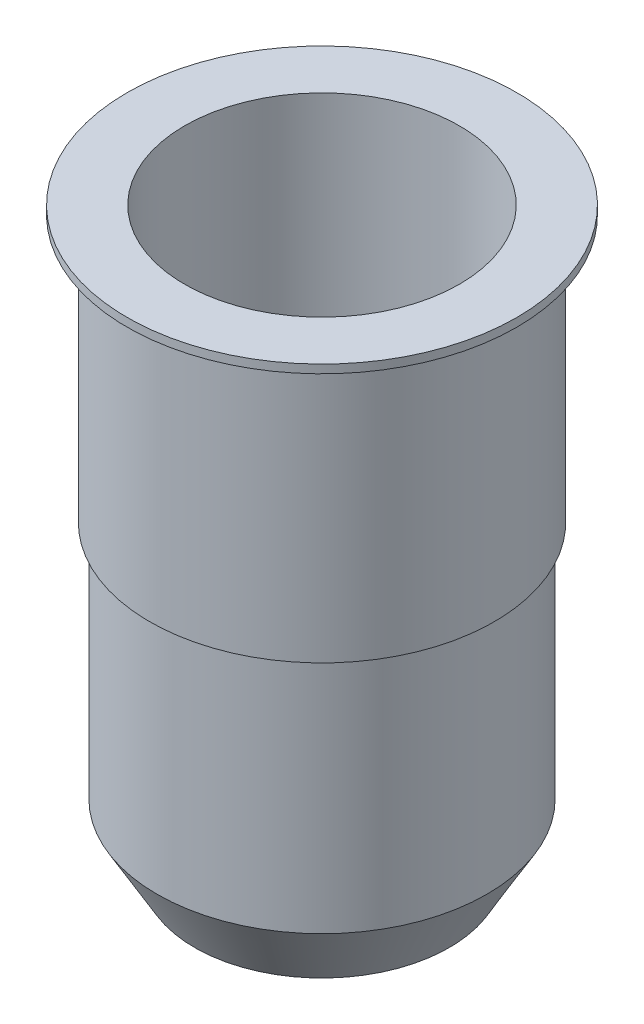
ISO-10303-21;
HEADER;
FILE_DESCRIPTION(('STEP AP214'),'2;1');
FILE_NAME('part.step','',(''),(''),'','','');
FILE_SCHEMA(('AUTOMOTIVE_DESIGN { 1 0 10303 214 1 1 1 1 }'));
ENDSEC;
DATA;
#1=APPLICATION_CONTEXT('core data for automotive mechanical design processes');
#2=APPLICATION_PROTOCOL_DEFINITION('international standard','automotive_design',2000,#1);
#3=PRODUCT_CONTEXT('',#1,'mechanical');
#4=PRODUCT('Part','Part','',(#3));
#5=PRODUCT_RELATED_PRODUCT_CATEGORY('part','',(#4));
#6=PRODUCT_DEFINITION_FORMATION('','',#4);
#7=PRODUCT_DEFINITION_CONTEXT('part definition',#1,'design');
#8=PRODUCT_DEFINITION('design','',#6,#7);
#9=PRODUCT_DEFINITION_SHAPE('','',#8);
#10=(LENGTH_UNIT() NAMED_UNIT(*) SI_UNIT(.MILLI.,.METRE.));
#11=(NAMED_UNIT(*) PLANE_ANGLE_UNIT() SI_UNIT($,.RADIAN.));
#12=(NAMED_UNIT(*) SI_UNIT($,.STERADIAN.) SOLID_ANGLE_UNIT());
#13=UNCERTAINTY_MEASURE_WITH_UNIT(LENGTH_MEASURE(1.E-05),#10,'distance_accuracy_value','');
#14=(GEOMETRIC_REPRESENTATION_CONTEXT(3) GLOBAL_UNCERTAINTY_ASSIGNED_CONTEXT((#13)) GLOBAL_UNIT_ASSIGNED_CONTEXT((#10,
#11,#12)) REPRESENTATION_CONTEXT('',''));
#15=CARTESIAN_POINT('',(0.,0.,0.));
#16=DIRECTION('',(0.,0.,1.));
#17=DIRECTION('',(1.,0.,0.));
#18=AXIS2_PLACEMENT_3D('',#15,#16,#17);
#19=CARTESIAN_POINT('',(3.3,-11.6,0.));
#20=DIRECTION('',(0.,1.,0.));
#21=DIRECTION('',(-1.,0.,0.));
#22=AXIS2_PLACEMENT_3D('',#19,#20,#21);
#23=PLANE('',#22);
#24=CARTESIAN_POINT('',(0.,-11.6,0.));
#25=DIRECTION('',(0.,1.,0.));
#26=DIRECTION('',(-1.,0.,0.));
#27=AXIS2_PLACEMENT_3D('',#24,#25,#26);
#28=CIRCLE('',#27,2.55);
#29=CARTESIAN_POINT('',(-2.54999999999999,-11.6,0.));
#30=VERTEX_POINT('',#29);
#31=EDGE_CURVE('E36',#30,#30,#28,.F.);
#32=ORIENTED_EDGE('',*,*,#31,.T.);
#33=EDGE_LOOP('',(#32));
#34=FACE_BOUND('',#33,.T.);
#35=CARTESIAN_POINT('',(0.,-11.6,0.));
#36=DIRECTION('',(0.,1.,0.));
#37=DIRECTION('',(-1.,0.,0.));
#38=AXIS2_PLACEMENT_3D('',#35,#36,#37);
#39=CIRCLE('',#38,2.1);
#40=CARTESIAN_POINT('',(-2.1,-11.6,0.));
#41=VERTEX_POINT('',#40);
#42=EDGE_CURVE('E45',#41,#41,#39,.T.);
#43=ORIENTED_EDGE('',*,*,#42,.T.);
#44=EDGE_LOOP('',(#43));
#45=FACE_BOUND('',#44,.T.);
#46=ADVANCED_FACE('F26',(#34,#45),#23,.F.);
#47=CARTESIAN_POINT('',(0.,6.30148961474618,0.));
#48=DIRECTION('',(0.,1.,0.));
#49=DIRECTION('',(-1.,0.,0.));
#50=AXIS2_PLACEMENT_3D('',#47,#48,#49);
#51=CYLINDRICAL_SURFACE('',#50,2.1);
#52=ORIENTED_EDGE('',*,*,#42,.F.);
#53=EDGE_LOOP('',(#52));
#54=FACE_BOUND('',#53,.T.);
#55=CARTESIAN_POINT('',(0.,-6.,0.));
#56=DIRECTION('',(0.,1.,0.));
#57=DIRECTION('',(-1.,0.,0.));
#58=AXIS2_PLACEMENT_3D('',#55,#56,#57);
#59=CIRCLE('',#58,2.1);
#60=CARTESIAN_POINT('',(-2.1,-6.,0.));
#61=VERTEX_POINT('',#60);
#62=EDGE_CURVE('E48',#61,#61,#59,.T.);
#63=ORIENTED_EDGE('',*,*,#62,.T.);
#64=EDGE_LOOP('',(#63));
#65=FACE_BOUND('',#64,.T.);
#66=ADVANCED_FACE('F88',(#54,#65),#51,.F.);
#67=CARTESIAN_POINT('',(2.1,-6.,0.));
#68=DIRECTION('',(0.,-1.,0.));
#69=DIRECTION('',(1.,0.,0.));
#70=AXIS2_PLACEMENT_3D('',#67,#68,#69);
#71=PLANE('',#70);
#72=ORIENTED_EDGE('',*,*,#62,.F.);
#73=EDGE_LOOP('',(#72));
#74=FACE_BOUND('',#73,.T.);
#75=CARTESIAN_POINT('',(0.,-6.,0.));
#76=DIRECTION('',(0.,1.,0.));
#77=DIRECTION('',(-1.,0.,0.));
#78=AXIS2_PLACEMENT_3D('',#75,#76,#77);
#79=CIRCLE('',#78,2.75);
#80=CARTESIAN_POINT('',(-2.75,-6.,0.));
#81=VERTEX_POINT('',#80);
#82=EDGE_CURVE('E51',#81,#81,#79,.T.);
#83=ORIENTED_EDGE('',*,*,#82,.T.);
#84=EDGE_LOOP('',(#83));
#85=FACE_BOUND('',#84,.T.);
#86=ADVANCED_FACE('F93',(#74,#85),#71,.F.);
#87=CARTESIAN_POINT('',(0.,6.30148961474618,0.));
#88=DIRECTION('',(0.,1.,0.));
#89=DIRECTION('',(-1.,0.,0.));
#90=AXIS2_PLACEMENT_3D('',#87,#88,#89);
#91=CYLINDRICAL_SURFACE('',#90,2.75);
#92=ORIENTED_EDGE('',*,*,#82,.F.);
#93=EDGE_LOOP('',(#92));
#94=FACE_BOUND('',#93,.T.);
#95=CARTESIAN_POINT('',(0.,0.,0.));
#96=DIRECTION('',(0.,1.,0.));
#97=DIRECTION('',(-1.,0.,0.));
#98=AXIS2_PLACEMENT_3D('',#95,#96,#97);
#99=CIRCLE('',#98,2.75);
#100=CARTESIAN_POINT('',(-2.75,0.,0.));
#101=VERTEX_POINT('',#100);
#102=EDGE_CURVE('E54',#101,#101,#99,.T.);
#103=ORIENTED_EDGE('',*,*,#102,.T.);
#104=EDGE_LOOP('',(#103));
#105=FACE_BOUND('',#104,.T.);
#106=ADVANCED_FACE('F103',(#94,#105),#91,.F.);
#107=CARTESIAN_POINT('',(2.75,0.,0.));
#108=DIRECTION('',(0.,-1.,0.));
#109=DIRECTION('',(1.,0.,0.));
#110=AXIS2_PLACEMENT_3D('',#107,#108,#109);
#111=PLANE('',#110);
#112=ORIENTED_EDGE('',*,*,#102,.F.);
#113=EDGE_LOOP('',(#112));
#114=FACE_BOUND('',#113,.T.);
#115=CARTESIAN_POINT('',(0.,0.,0.));
#116=DIRECTION('',(0.,1.,0.));
#117=DIRECTION('',(-1.,0.,0.));
#118=AXIS2_PLACEMENT_3D('',#115,#116,#117);
#119=CIRCLE('',#118,3.9);
#120=CARTESIAN_POINT('',(-3.9,0.,0.));
#121=VERTEX_POINT('',#120);
#122=EDGE_CURVE('E57',#121,#121,#119,.T.);
#123=ORIENTED_EDGE('',*,*,#122,.T.);
#124=EDGE_LOOP('',(#123));
#125=FACE_BOUND('',#124,.T.);
#126=ADVANCED_FACE('F109',(#114,#125),#111,.F.);
#127=CARTESIAN_POINT('',(0.,6.30148961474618,0.));
#128=DIRECTION('',(0.,1.,0.));
#129=DIRECTION('',(-1.,0.,0.));
#130=AXIS2_PLACEMENT_3D('',#127,#128,#129);
#131=CYLINDRICAL_SURFACE('',#130,3.9);
#132=CARTESIAN_POINT('',(0.,-0.16905989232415,0.));
#133=DIRECTION('',(0.,1.,0.));
#134=DIRECTION('',(-1.,0.,0.));
#135=AXIS2_PLACEMENT_3D('',#132,#133,#134);
#136=CIRCLE('',#135,3.9);
#137=CARTESIAN_POINT('',(-3.9,-0.169059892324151,0.));
#138=VERTEX_POINT('',#137);
#139=EDGE_CURVE('E32',#138,#138,#136,.T.);
#140=ORIENTED_EDGE('',*,*,#139,.T.);
#141=EDGE_LOOP('',(#140));
#142=FACE_BOUND('',#141,.T.);
#143=ORIENTED_EDGE('',*,*,#122,.F.);
#144=EDGE_LOOP('',(#143));
#145=FACE_BOUND('',#144,.T.);
#146=ADVANCED_FACE('F115',(#142,#145),#131,.T.);
#147=CARTESIAN_POINT('',(3.44999999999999,-0.4,0.));
#148=DIRECTION('',(0.,1.,0.));
#149=DIRECTION('',(-1.,0.,0.));
#150=AXIS2_PLACEMENT_3D('',#147,#148,#149);
#151=PLANE('',#150);
#152=CARTESIAN_POINT('',(0.,-0.400000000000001,0.));
#153=DIRECTION('',(0.,1.,0.));
#154=DIRECTION('',(-1.,0.,0.));
#155=AXIS2_PLACEMENT_3D('',#152,#153,#154);
#156=CIRCLE('',#155,3.5);
#157=CARTESIAN_POINT('',(-3.5,-0.400000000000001,0.));
#158=VERTEX_POINT('',#157);
#159=EDGE_CURVE('E10',#158,#158,#156,.F.);
#160=ORIENTED_EDGE('',*,*,#159,.T.);
#161=EDGE_LOOP('',(#160));
#162=FACE_BOUND('',#161,.T.);
#163=CARTESIAN_POINT('',(0.,-0.400000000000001,0.));
#164=DIRECTION('',(0.,1.,0.));
#165=DIRECTION('',(-1.,0.,0.));
#166=AXIS2_PLACEMENT_3D('',#163,#164,#165);
#167=CIRCLE('',#166,3.44999999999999);
#168=CARTESIAN_POINT('',(-3.44999999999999,-0.400000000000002,0.));
#169=VERTEX_POINT('',#168);
#170=EDGE_CURVE('E60',#169,#169,#167,.T.);
#171=ORIENTED_EDGE('',*,*,#170,.T.);
#172=EDGE_LOOP('',(#171));
#173=FACE_BOUND('',#172,.T.);
#174=ADVANCED_FACE('F120',(#162,#173),#151,.F.);
#175=CARTESIAN_POINT('',(0.,6.30148961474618,0.));
#176=DIRECTION('',(0.,1.,0.));
#177=DIRECTION('',(-1.,0.,0.));
#178=AXIS2_PLACEMENT_3D('',#175,#176,#177);
#179=CYLINDRICAL_SURFACE('',#178,3.44999999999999);
#180=ORIENTED_EDGE('',*,*,#170,.F.);
#181=EDGE_LOOP('',(#180));
#182=FACE_BOUND('',#181,.T.);
#183=CARTESIAN_POINT('',(0.,-5.5,0.));
#184=DIRECTION('',(0.,1.,0.));
#185=DIRECTION('',(-1.,0.,0.));
#186=AXIS2_PLACEMENT_3D('',#183,#184,#185);
#187=CIRCLE('',#186,3.44999999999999);
#188=CARTESIAN_POINT('',(-3.44999999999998,-5.5,0.));
#189=VERTEX_POINT('',#188);
#190=EDGE_CURVE('E63',#189,#189,#187,.T.);
#191=ORIENTED_EDGE('',*,*,#190,.T.);
#192=EDGE_LOOP('',(#191));
#193=FACE_BOUND('',#192,.T.);
#194=ADVANCED_FACE('F84',(#182,#193),#179,.T.);
#195=CARTESIAN_POINT('',(3.3,-5.5,0.));
#196=DIRECTION('',(0.,1.,0.));
#197=DIRECTION('',(-1.,0.,0.));
#198=AXIS2_PLACEMENT_3D('',#195,#196,#197);
#199=PLANE('',#198);
#200=ORIENTED_EDGE('',*,*,#190,.F.);
#201=EDGE_LOOP('',(#200));
#202=FACE_BOUND('',#201,.T.);
#203=CARTESIAN_POINT('',(0.,-5.5,0.));
#204=DIRECTION('',(0.,1.,0.));
#205=DIRECTION('',(-1.,0.,0.));
#206=AXIS2_PLACEMENT_3D('',#203,#204,#205);
#207=CIRCLE('',#206,3.3);
#208=CARTESIAN_POINT('',(-3.3,-5.5,0.));
#209=VERTEX_POINT('',#208);
#210=EDGE_CURVE('E66',#209,#209,#207,.T.);
#211=ORIENTED_EDGE('',*,*,#210,.T.);
#212=EDGE_LOOP('',(#211));
#213=FACE_BOUND('',#212,.T.);
#214=ADVANCED_FACE('F70',(#202,#213),#199,.F.);
#215=CARTESIAN_POINT('',(0.,6.30148961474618,0.));
#216=DIRECTION('',(0.,1.,0.));
#217=DIRECTION('',(-1.,0.,0.));
#218=AXIS2_PLACEMENT_3D('',#215,#216,#217);
#219=CYLINDRICAL_SURFACE('',#218,3.3);
#220=CARTESIAN_POINT('',(0.,-10.3009618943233,0.));
#221=DIRECTION('',(0.,1.,0.));
#222=DIRECTION('',(-1.,0.,0.));
#223=AXIS2_PLACEMENT_3D('',#220,#221,#222);
#224=CIRCLE('',#223,3.3);
#225=CARTESIAN_POINT('',(-3.3,-10.3009618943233,0.));
#226=VERTEX_POINT('',#225);
#227=EDGE_CURVE('E40',#226,#226,#224,.T.);
#228=ORIENTED_EDGE('',*,*,#227,.T.);
#229=EDGE_LOOP('',(#228));
#230=FACE_BOUND('',#229,.T.);
#231=ORIENTED_EDGE('',*,*,#210,.F.);
#232=EDGE_LOOP('',(#231));
#233=FACE_BOUND('',#232,.T.);
#234=ADVANCED_FACE('F72',(#230,#233),#219,.T.);
#235=CARTESIAN_POINT('',(0.,-10.3009618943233,0.));
#236=DIRECTION('',(0.,1.,0.));
#237=DIRECTION('',(-1.,0.,0.));
#238=AXIS2_PLACEMENT_3D('',#235,#236,#237);
#239=CONICAL_SURFACE('',#238,3.3,0.5235987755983);
#240=CARTESIAN_POINT('',(-2.54999999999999,-11.6,0.));
#241=CARTESIAN_POINT('',(-2.55781249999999,-11.5864683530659,0.));
#242=CARTESIAN_POINT('',(-2.56562499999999,-11.5729367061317,0.));
#243=CARTESIAN_POINT('',(-2.58124999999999,-11.5458734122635,0.));
#244=CARTESIAN_POINT('',(-2.58906249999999,-11.5323417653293,0.));
#245=CARTESIAN_POINT('',(-2.60468749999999,-11.5052784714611,0.));
#246=CARTESIAN_POINT('',(-2.61249999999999,-11.4917468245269,0.));
#247=CARTESIAN_POINT('',(-2.62812499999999,-11.4646835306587,0.));
#248=CARTESIAN_POINT('',(-2.63593749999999,-11.4511518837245,0.));
#249=CARTESIAN_POINT('',(-2.65156249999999,-11.4240885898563,0.));
#250=CARTESIAN_POINT('',(-2.65937499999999,-11.4105569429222,0.));
#251=CARTESIAN_POINT('',(-2.67499999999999,-11.3834936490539,0.));
#252=CARTESIAN_POINT('',(-2.68281249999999,-11.3699620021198,0.));
#253=CARTESIAN_POINT('',(-2.69843749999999,-11.3428987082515,0.));
#254=CARTESIAN_POINT('',(-2.70624999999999,-11.3293670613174,0.));
#255=CARTESIAN_POINT('',(-2.72187499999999,-11.3023037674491,0.));
#256=CARTESIAN_POINT('',(-2.72968749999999,-11.288772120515,0.));
#257=CARTESIAN_POINT('',(-2.74531249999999,-11.2617088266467,0.));
#258=CARTESIAN_POINT('',(-2.753125,-11.2481771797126,0.));
#259=CARTESIAN_POINT('',(-2.76875,-11.2211138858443,0.));
#260=CARTESIAN_POINT('',(-2.7765625,-11.2075822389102,0.));
#261=CARTESIAN_POINT('',(-2.7921875,-11.1805189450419,0.));
#262=CARTESIAN_POINT('',(-2.8,-11.1669872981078,0.));
#263=CARTESIAN_POINT('',(-2.815625,-11.1399240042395,0.));
#264=CARTESIAN_POINT('',(-2.8234375,-11.1263923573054,0.));
#265=CARTESIAN_POINT('',(-2.8390625,-11.0993290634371,0.));
#266=CARTESIAN_POINT('',(-2.846875,-11.085797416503,0.));
#267=CARTESIAN_POINT('',(-2.8625,-11.0587341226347,0.));
#268=CARTESIAN_POINT('',(-2.8703125,-11.0452024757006,0.));
#269=CARTESIAN_POINT('',(-2.8859375,-11.0181391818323,0.));
#270=CARTESIAN_POINT('',(-2.89375,-11.0046075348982,0.));
#271=CARTESIAN_POINT('',(-2.909375,-10.9775442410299,0.));
#272=CARTESIAN_POINT('',(-2.9171875,-10.9640125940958,0.));
#273=CARTESIAN_POINT('',(-2.9328125,-10.9369493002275,0.));
#274=CARTESIAN_POINT('',(-2.940625,-10.9234176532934,0.));
#275=CARTESIAN_POINT('',(-2.95625,-10.8963543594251,0.));
#276=CARTESIAN_POINT('',(-2.9640625,-10.882822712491,0.));
#277=CARTESIAN_POINT('',(-2.9796875,-10.8557594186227,0.));
#278=CARTESIAN_POINT('',(-2.9875,-10.8422277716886,0.));
#279=CARTESIAN_POINT('',(-3.003125,-10.8151644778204,0.));
#280=CARTESIAN_POINT('',(-3.0109375,-10.8016328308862,0.));
#281=CARTESIAN_POINT('',(-3.0265625,-10.774569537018,0.));
#282=CARTESIAN_POINT('',(-3.034375,-10.7610378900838,0.));
#283=CARTESIAN_POINT('',(-3.05,-10.7339745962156,0.));
#284=CARTESIAN_POINT('',(-3.0578125,-10.7204429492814,0.));
#285=CARTESIAN_POINT('',(-3.0734375,-10.6933796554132,0.));
#286=CARTESIAN_POINT('',(-3.08125,-10.679848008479,0.));
#287=CARTESIAN_POINT('',(-3.096875,-10.6527847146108,0.));
#288=CARTESIAN_POINT('',(-3.1046875,-10.6392530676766,0.));
#289=CARTESIAN_POINT('',(-3.1203125,-10.6121897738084,0.));
#290=CARTESIAN_POINT('',(-3.128125,-10.5986581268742,0.));
#291=CARTESIAN_POINT('',(-3.14375,-10.571594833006,0.));
#292=CARTESIAN_POINT('',(-3.1515625,-10.5580631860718,0.));
#293=CARTESIAN_POINT('',(-3.1671875,-10.5309998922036,0.));
#294=CARTESIAN_POINT('',(-3.175,-10.5174682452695,0.));
#295=CARTESIAN_POINT('',(-3.190625,-10.4904049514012,0.));
#296=CARTESIAN_POINT('',(-3.1984375,-10.4768733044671,0.));
#297=CARTESIAN_POINT('',(-3.2140625,-10.4498100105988,0.));
#298=CARTESIAN_POINT('',(-3.221875,-10.4362783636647,0.));
#299=CARTESIAN_POINT('',(-3.2375,-10.4092150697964,0.));
#300=CARTESIAN_POINT('',(-3.2453125,-10.3956834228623,0.));
#301=CARTESIAN_POINT('',(-3.2609375,-10.368620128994,0.));
#302=CARTESIAN_POINT('',(-3.26875,-10.3550884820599,0.));
#303=CARTESIAN_POINT('',(-3.284375,-10.3280251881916,0.));
#304=CARTESIAN_POINT('',(-3.2921875,-10.3144935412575,0.));
#305=CARTESIAN_POINT('',(-3.3,-10.3009618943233,0.));
#306=B_SPLINE_CURVE_WITH_KNOTS('',3,(#240,#241,#242,#243,#244,#245,#246,#247,#248,#249,#250,
#251,#252,#253,#254,#255,#256,#257,#258,#259,#260,#261,#262,#263,#264,#265,#266,#267,#268,#269,
#270,#271,#272,#273,#274,#275,#276,#277,#278,#279,#280,#281,#282,#283,#284,#285,#286,#287,#288,
#289,#290,#291,#292,#293,#294,#295,#296,#297,#298,#299,#300,#301,#302,#303,#304,#305),
.UNSPECIFIED.,.F.,.F.,(4,2,2,2,2,2,2,2,2,2,2,2,2,2,2,2,2,2,2,2,2,2,2,2,2,2,2,2,2,2,2,2,4),(0.,
0.0468750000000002,0.0937500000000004,0.140625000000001,0.187500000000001,0.234375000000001,
0.281250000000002,0.328125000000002,0.375,0.421875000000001,0.468750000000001,0.515625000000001,
0.562500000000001,0.609375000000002,0.656250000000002,0.703125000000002,0.75,0.796875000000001,
0.843750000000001,0.890625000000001,0.937500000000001,0.984375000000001,1.03125,1.078125,1.125,
1.171875,1.21875,1.265625,1.3125,1.359375,1.40625,1.453125,1.5),.UNSPECIFIED.);
#307=EDGE_CURVE('BSEAM74',#30,#226,#306,.T.);
#308=ORIENTED_EDGE('',*,*,#31,.F.);
#309=ORIENTED_EDGE('',*,*,#227,.F.);
#310=ORIENTED_EDGE('',*,*,#307,.T.);
#311=ORIENTED_EDGE('',*,*,#307,.F.);
#312=EDGE_LOOP('',(#308,#310,#309,#311));
#313=FACE_BOUND('',#312,.T.);
#314=ADVANCED_FACE('F74',(#313),#239,.T.);
#315=CARTESIAN_POINT('',(0.,-0.16905989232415,0.));
#316=DIRECTION('',(0.,1.,0.));
#317=DIRECTION('',(-1.,0.,0.));
#318=AXIS2_PLACEMENT_3D('',#315,#316,#317);
#319=CONICAL_SURFACE('',#318,3.9,1.0471975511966);
#320=ORIENTED_EDGE('',*,*,#159,.F.);
#321=EDGE_LOOP('',(#320));
#322=FACE_BOUND('',#321,.T.);
#323=ORIENTED_EDGE('',*,*,#139,.F.);
#324=EDGE_LOOP('',(#323));
#325=FACE_BOUND('',#324,.T.);
#326=ADVANCED_FACE('F81',(#322,#325),#319,.T.);
#327=CLOSED_SHELL('',(#46,#66,#86,#106,#126,#146,#174,#194,#214,#234,#314,#326));
#328=MANIFOLD_SOLID_BREP('B2',#327);
#329=ADVANCED_BREP_SHAPE_REPRESENTATION('',(#18,#328),#14);
#330=SHAPE_DEFINITION_REPRESENTATION(#9,#329);
ENDSEC;
END-ISO-10303-21;
